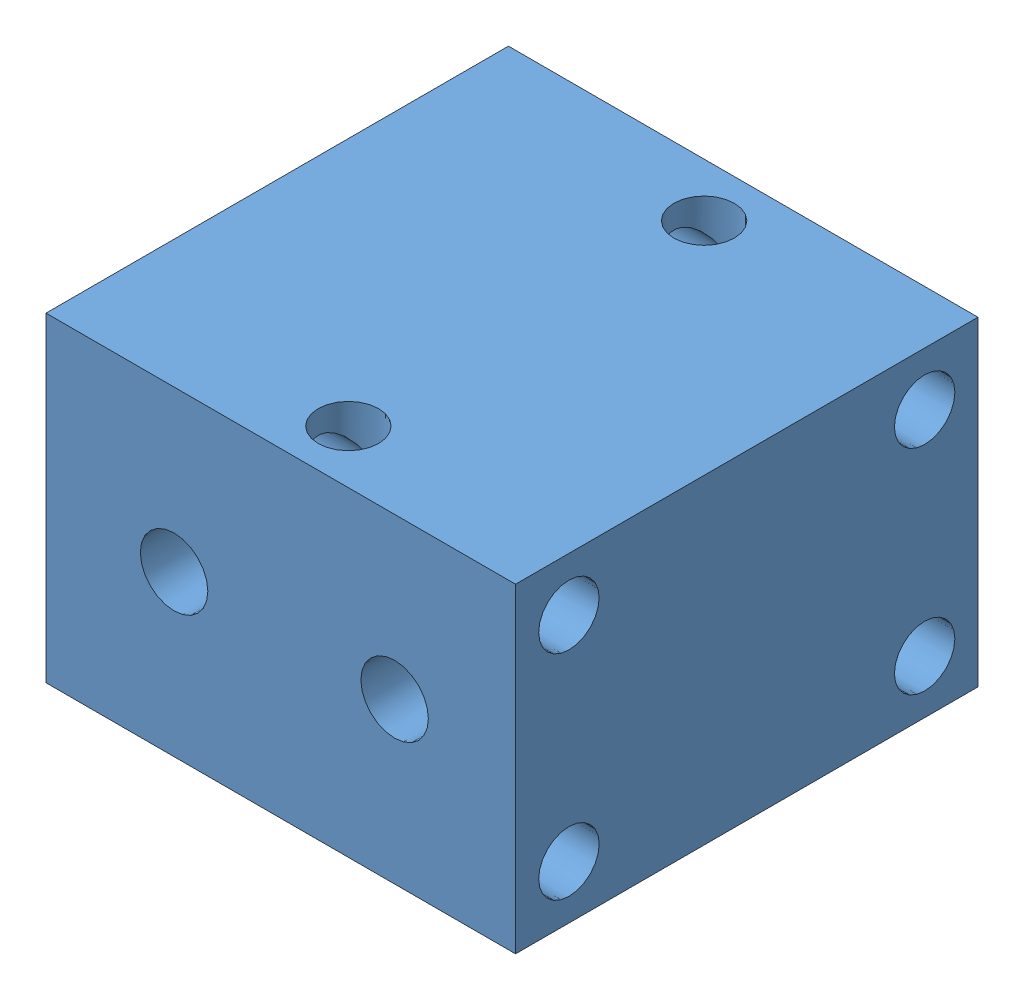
SolidWorks assembly 0202.SLDASM, configuration Default (file format 4400). Lengths in mm.
Overall size (74 45 65).
2 component instances, 2 part files, 3 mates.
Components (placement in the parent):
- 0201-1: 0201.SLDPRT [Default] at (-14.573 -15.9238 3.2222) size (66 45 65)
- 0202-FP-1: 0202-FP.SLDPRT [Default] at (-55.573 6.5762 3.2222) x (0 0 -1) z (-1 0 0) size (16 16 50)
Mates (geometry in assembly coordinates):
- Concentric1: concentric aligned: cylinder of 0201-1 through (12.427 6.5762 3.2222) axis (-1 0 0) radius 0.5; cylinder of 0202-FP-1 through (-32.573 6.5762 3.2222) axis (-1 0 0) radius 8
- Distance1: distance = 74 mm anti-aligned: plane of 0202-FP-1 through (-55.573 6.5762 3.2222) normal (-1 0 0); plane of 0201-1 through (18.427 29.0762 -29.2778) normal (1 0 0)
- Parallel1: parallel aligned: plane of 0201-1 through (-47.573 29.0762 -29.2778) normal (0 0 -1); plane of 0202-FP-1 through (-82.573 16.5762 -3.7778) normal (0 0 -1)
